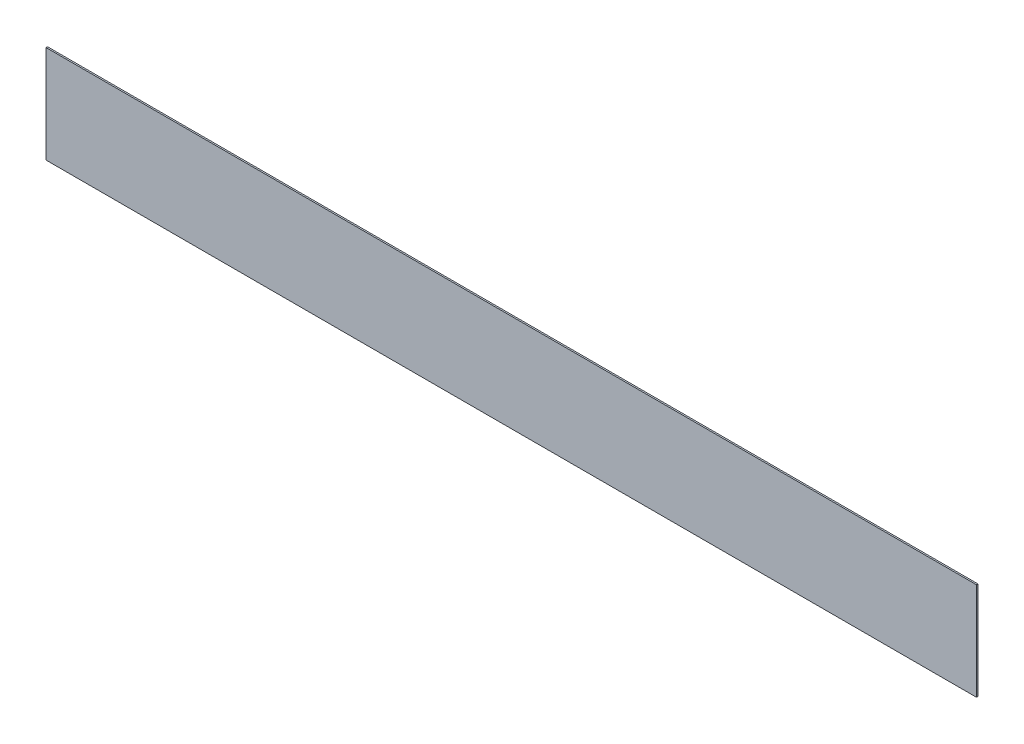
ISO-10303-21;
HEADER;
FILE_DESCRIPTION(('STEP AP214'),'2;1');
FILE_NAME('part.step','',(''),(''),'','','');
FILE_SCHEMA(('AUTOMOTIVE_DESIGN { 1 0 10303 214 1 1 1 1 }'));
ENDSEC;
DATA;
#1=APPLICATION_CONTEXT('core data for automotive mechanical design processes');
#2=APPLICATION_PROTOCOL_DEFINITION('international standard','automotive_design',2000,#1);
#3=PRODUCT_CONTEXT('',#1,'mechanical');
#4=PRODUCT('Part','Part','',(#3));
#5=PRODUCT_RELATED_PRODUCT_CATEGORY('part','',(#4));
#6=PRODUCT_DEFINITION_FORMATION('','',#4);
#7=PRODUCT_DEFINITION_CONTEXT('part definition',#1,'design');
#8=PRODUCT_DEFINITION('design','',#6,#7);
#9=PRODUCT_DEFINITION_SHAPE('','',#8);
#10=(LENGTH_UNIT() NAMED_UNIT(*) SI_UNIT(.MILLI.,.METRE.));
#11=(NAMED_UNIT(*) PLANE_ANGLE_UNIT() SI_UNIT($,.RADIAN.));
#12=(NAMED_UNIT(*) SI_UNIT($,.STERADIAN.) SOLID_ANGLE_UNIT());
#13=UNCERTAINTY_MEASURE_WITH_UNIT(LENGTH_MEASURE(1.E-05),#10,'distance_accuracy_value','');
#14=(GEOMETRIC_REPRESENTATION_CONTEXT(3) GLOBAL_UNCERTAINTY_ASSIGNED_CONTEXT((#13)) GLOBAL_UNIT_ASSIGNED_CONTEXT((#10,
#11,#12)) REPRESENTATION_CONTEXT('',''));
#15=CARTESIAN_POINT('',(0.,0.,0.));
#16=DIRECTION('',(0.,0.,1.));
#17=DIRECTION('',(1.,0.,0.));
#18=AXIS2_PLACEMENT_3D('',#15,#16,#17);
#19=CARTESIAN_POINT('',(0.,0.,0.8));
#20=DIRECTION('',(0.,0.,1.));
#21=DIRECTION('',(1.,0.,0.));
#22=AXIS2_PLACEMENT_3D('',#19,#20,#21);
#23=PLANE('',#22);
#24=DIRECTION('',(1.,0.,0.));
#25=VECTOR('',#24,1.);
#26=CARTESIAN_POINT('',(27.4708905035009,246.758870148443,0.8));
#27=LINE('',#26,#25);
#28=CARTESIAN_POINT('',(27.4708905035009,246.758870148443,0.8));
#29=VERTEX_POINT('',#28);
#30=CARTESIAN_POINT('',(530.241857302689,246.758870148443,0.8));
#31=VERTEX_POINT('',#30);
#32=EDGE_CURVE('E20',#29,#31,#27,.T.);
#33=ORIENTED_EDGE('',*,*,#32,.F.);
#34=DIRECTION('',(0.,1.,0.));
#35=VECTOR('',#34,1.);
#36=CARTESIAN_POINT('',(27.4708905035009,246.758870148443,0.8));
#37=LINE('',#36,#35);
#38=CARTESIAN_POINT('',(27.4708905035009,194.10201589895,0.8));
#39=VERTEX_POINT('',#38);
#40=EDGE_CURVE('E58',#39,#29,#37,.T.);
#41=ORIENTED_EDGE('',*,*,#40,.F.);
#42=DIRECTION('',(1.,0.,0.));
#43=VECTOR('',#42,1.);
#44=CARTESIAN_POINT('',(27.4708905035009,194.10201589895,0.8));
#45=LINE('',#44,#43);
#46=CARTESIAN_POINT('',(530.241857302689,194.10201589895,0.8));
#47=VERTEX_POINT('',#46);
#48=EDGE_CURVE('E53',#47,#39,#45,.F.);
#49=ORIENTED_EDGE('',*,*,#48,.F.);
#50=DIRECTION('',(0.,1.,0.));
#51=VECTOR('',#50,1.);
#52=CARTESIAN_POINT('',(530.241857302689,246.758870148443,0.8));
#53=LINE('',#52,#51);
#54=EDGE_CURVE('E68',#31,#47,#53,.F.);
#55=ORIENTED_EDGE('',*,*,#54,.F.);
#56=EDGE_LOOP('',(#33,#41,#49,#55));
#57=FACE_BOUND('',#56,.T.);
#58=ADVANCED_FACE('F17',(#57),#23,.T.);
#59=CARTESIAN_POINT('',(27.4708905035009,246.758870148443,-9.2));
#60=DIRECTION('',(0.,1.,0.));
#61=DIRECTION('',(0.,0.,1.));
#62=AXIS2_PLACEMENT_3D('',#59,#60,#61);
#63=PLANE('',#62);
#64=ORIENTED_EDGE('',*,*,#32,.T.);
#65=DIRECTION('',(0.,0.,-1.));
#66=VECTOR('',#65,1.);
#67=CARTESIAN_POINT('',(530.241857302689,246.758870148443,-9.2));
#68=LINE('',#67,#66);
#69=CARTESIAN_POINT('',(530.241857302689,246.758870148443,0.));
#70=VERTEX_POINT('',#69);
#71=EDGE_CURVE('E79',#70,#31,#68,.F.);
#72=ORIENTED_EDGE('',*,*,#71,.F.);
#73=DIRECTION('',(1.,0.,0.));
#74=VECTOR('',#73,1.);
#75=CARTESIAN_POINT('',(0.,246.758870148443,0.));
#76=LINE('',#75,#74);
#77=CARTESIAN_POINT('',(27.4708905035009,246.758870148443,0.));
#78=VERTEX_POINT('',#77);
#79=EDGE_CURVE('E74',#70,#78,#76,.F.);
#80=ORIENTED_EDGE('',*,*,#79,.T.);
#81=DIRECTION('',(0.,0.,1.));
#82=VECTOR('',#81,1.);
#83=CARTESIAN_POINT('',(27.4708905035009,246.758870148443,-9.2));
#84=LINE('',#83,#82);
#85=EDGE_CURVE('E63',#29,#78,#84,.F.);
#86=ORIENTED_EDGE('',*,*,#85,.F.);
#87=EDGE_LOOP('',(#64,#72,#80,#86));
#88=FACE_BOUND('',#87,.T.);
#89=ADVANCED_FACE('F73',(#88),#63,.T.);
#90=CARTESIAN_POINT('',(27.4708905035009,246.758870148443,-9.2));
#91=DIRECTION('',(-1.,0.,0.));
#92=DIRECTION('',(0.,0.,1.));
#93=AXIS2_PLACEMENT_3D('',#90,#91,#92);
#94=PLANE('',#93);
#95=ORIENTED_EDGE('',*,*,#40,.T.);
#96=ORIENTED_EDGE('',*,*,#85,.T.);
#97=DIRECTION('',(0.,1.,0.));
#98=VECTOR('',#97,1.);
#99=CARTESIAN_POINT('',(27.4708905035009,0.,0.));
#100=LINE('',#99,#98);
#101=CARTESIAN_POINT('',(27.4708905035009,194.10201589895,0.));
#102=VERTEX_POINT('',#101);
#103=EDGE_CURVE('E84',#78,#102,#100,.F.);
#104=ORIENTED_EDGE('',*,*,#103,.T.);
#105=DIRECTION('',(0.,0.,-1.));
#106=VECTOR('',#105,1.);
#107=CARTESIAN_POINT('',(27.4708905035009,194.10201589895,-9.2));
#108=LINE('',#107,#106);
#109=EDGE_CURVE('E65',#39,#102,#108,.T.);
#110=ORIENTED_EDGE('',*,*,#109,.F.);
#111=EDGE_LOOP('',(#95,#96,#104,#110));
#112=FACE_BOUND('',#111,.T.);
#113=ADVANCED_FACE('F60',(#112),#94,.T.);
#114=CARTESIAN_POINT('',(27.4708905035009,194.10201589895,-9.2));
#115=DIRECTION('',(0.,-1.,0.));
#116=DIRECTION('',(0.,0.,-1.));
#117=AXIS2_PLACEMENT_3D('',#114,#115,#116);
#118=PLANE('',#117);
#119=ORIENTED_EDGE('',*,*,#48,.T.);
#120=ORIENTED_EDGE('',*,*,#109,.T.);
#121=DIRECTION('',(1.,0.,0.));
#122=VECTOR('',#121,1.);
#123=CARTESIAN_POINT('',(0.,194.10201589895,0.));
#124=LINE('',#123,#122);
#125=CARTESIAN_POINT('',(530.241857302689,194.10201589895,0.));
#126=VERTEX_POINT('',#125);
#127=EDGE_CURVE('E26',#102,#126,#124,.T.);
#128=ORIENTED_EDGE('',*,*,#127,.T.);
#129=DIRECTION('',(0.,0.,-1.));
#130=VECTOR('',#129,1.);
#131=CARTESIAN_POINT('',(530.241857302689,194.10201589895,-9.2));
#132=LINE('',#131,#130);
#133=EDGE_CURVE('E34',#47,#126,#132,.T.);
#134=ORIENTED_EDGE('',*,*,#133,.F.);
#135=EDGE_LOOP('',(#119,#120,#128,#134));
#136=FACE_BOUND('',#135,.T.);
#137=ADVANCED_FACE('F88',(#136),#118,.T.);
#138=CARTESIAN_POINT('',(530.241857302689,246.758870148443,-9.2));
#139=DIRECTION('',(1.,0.,0.));
#140=DIRECTION('',(0.,0.,-1.));
#141=AXIS2_PLACEMENT_3D('',#138,#139,#140);
#142=PLANE('',#141);
#143=ORIENTED_EDGE('',*,*,#54,.T.);
#144=ORIENTED_EDGE('',*,*,#133,.T.);
#145=DIRECTION('',(0.,1.,0.));
#146=VECTOR('',#145,1.);
#147=CARTESIAN_POINT('',(530.241857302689,0.,0.));
#148=LINE('',#147,#146);
#149=EDGE_CURVE('E11',#126,#70,#148,.T.);
#150=ORIENTED_EDGE('',*,*,#149,.T.);
#151=ORIENTED_EDGE('',*,*,#71,.T.);
#152=EDGE_LOOP('',(#143,#144,#150,#151));
#153=FACE_BOUND('',#152,.T.);
#154=ADVANCED_FACE('F91',(#153),#142,.T.);
#155=CARTESIAN_POINT('',(0.,0.,0.));
#156=DIRECTION('',(0.,0.,1.));
#157=DIRECTION('',(1.,0.,0.));
#158=AXIS2_PLACEMENT_3D('',#155,#156,#157);
#159=PLANE('',#158);
#160=ORIENTED_EDGE('',*,*,#127,.F.);
#161=ORIENTED_EDGE('',*,*,#103,.F.);
#162=ORIENTED_EDGE('',*,*,#79,.F.);
#163=ORIENTED_EDGE('',*,*,#149,.F.);
#164=EDGE_LOOP('',(#160,#161,#162,#163));
#165=FACE_BOUND('',#164,.T.);
#166=ADVANCED_FACE('F90',(#165),#159,.F.);
#167=CLOSED_SHELL('',(#58,#89,#113,#137,#154,#166));
#168=MANIFOLD_SOLID_BREP('B1',#167);
#169=ADVANCED_BREP_SHAPE_REPRESENTATION('',(#18,#168),#14);
#170=SHAPE_DEFINITION_REPRESENTATION(#9,#169);
ENDSEC;
END-ISO-10303-21;
